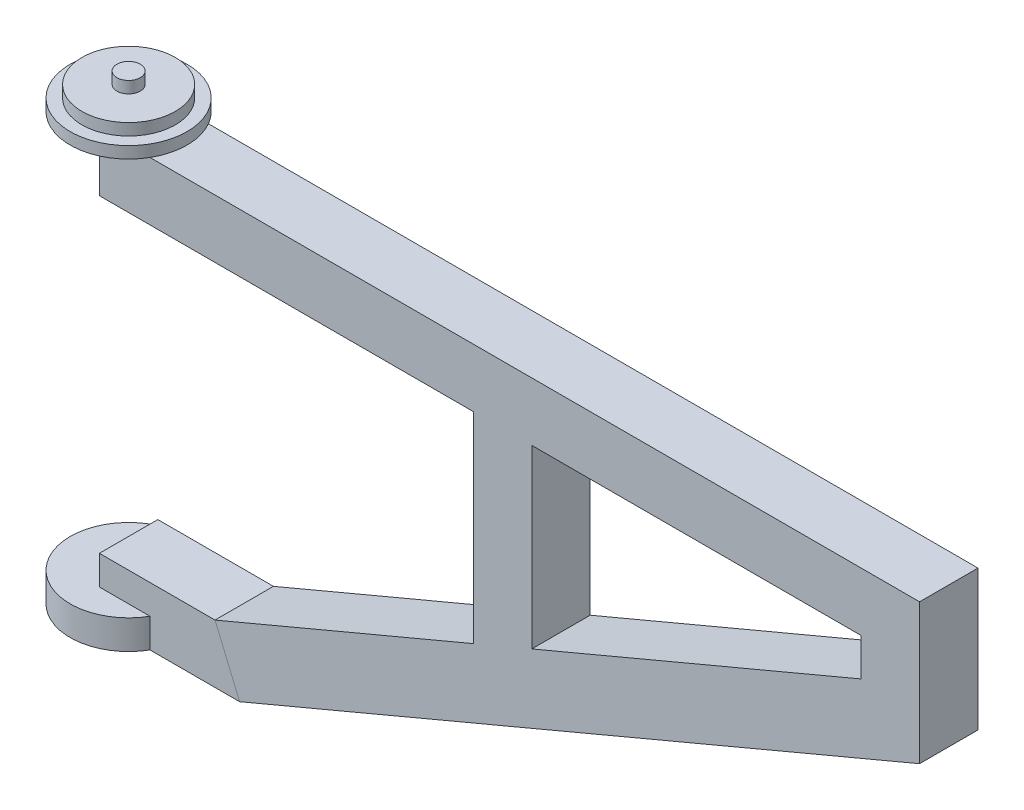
from build123d import *

# Parameters (mm, degrees)
SKETCH1_R            = 12.7
BOSS_EXTRUDE1_DEPTH  = 12.7
SKETCH2_R            = 50.8
BOSS_EXTRUDE2_DEPTH  = 12.7
SKETCH3_R            = 63.5
BOSS_EXTRUDE3_DEPTH  = 12.7
SKETCH5_R            = 63.5
BOSS_EXTRUDE5_DEPTH  = 31.75
SKETCH6_W            = 891.391767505
SKETCH6_H            = 63.5
BOSS_EXTRUDE6_DEPTH  = 63.5
SKETCH7_W            = 891.391767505
SKETCH7_H            = 63.5
BOSS_EXTRUDE7_DEPTH  = 63.5
SKETCH8_W            = 63.5
SKETCH8_H            = 463.55
BOSS_EXTRUDE8_DEPTH  = 63.5
SKETCH9_W            = 63.5
SKETCH9_H            = 463.55
BOSS_EXTRUDE9_DEPTH  = 63.5
CUT_EXTRUDE1_DEPTH   = 1028.280179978
BOSS_EXTRUDE10_DEPTH = 63.5


with BuildPart() as part:
    # Sketch1 → Boss-Extrude1 (new body)
    with BuildSketch(Plane(origin=(0, 0, 0), x_dir=(1, 0, 0), z_dir=(0, 1, 0))):
        with Locations(Location((0, 0, 0), (0, 0, 270))):
            Circle(SKETCH1_R)
    extrude(amount=-BOSS_EXTRUDE1_DEPTH)

    # Sketch2 → Boss-Extrude2 (add)
    with BuildSketch(Plane.XZ.offset(12.7)):
        with Locations(Location((0, 0, 0), (0, 0, 270))):
            Circle(SKETCH2_R)
    extrude(amount=BOSS_EXTRUDE2_DEPTH)

    # Sketch3 → Boss-Extrude3 (add)
    with BuildSketch(Plane.XZ.offset(25.4)):
        with Locations(Location((0, 0, 0), (0, 0, 270))):
            Circle(SKETCH3_R)
    extrude(amount=BOSS_EXTRUDE3_DEPTH)

    # Sketch7 → Boss-Extrude7 (add)
    with BuildSketch(Plane.XZ.offset(38.1)):
        with Locations((445.695883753, 0)):
            Rectangle(SKETCH7_W, SKETCH7_H)
    extrude(amount=BOSS_EXTRUDE7_DEPTH)



with BuildPart() as body_2:
    # Sketch5 → Boss-Extrude5 (new body)
    with BuildSketch(Plane(origin=(0, -501.65, 0), x_dir=(-1, 0, 0), z_dir=(0, -1, 0))):
        with Locations(Location((0, 0, 0), (0, 0, 90))):
            Circle(SKETCH5_R)
    extrude(amount=-BOSS_EXTRUDE5_DEPTH)

    # Sketch6 → Boss-Extrude6 (add)
    with BuildSketch(Plane.XZ.offset(501.65)):
        with Locations((445.695883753, 0)):
            Rectangle(SKETCH6_W, SKETCH6_H)
    extrude(amount=-BOSS_EXTRUDE6_DEPTH)


with BuildPart() as part_1:
    add(part.part)

    add(body_2.part)  # Boss-Extrude8 merges body 2
    # Sketch8 → Boss-Extrude8 (add)
    with BuildSketch(Plane(origin=(0, 0, -31.75), x_dir=(-1, 0, 0), z_dir=(0, 0, -1))):
        with Locations((-859.641767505, -269.875)):
            Rectangle(SKETCH8_W, SKETCH8_H)
    extrude(amount=-BOSS_EXTRUDE8_DEPTH)

    # Sketch9 → Boss-Extrude9 (add)
    with BuildSketch(Plane(origin=(0, 0, -31.75), x_dir=(-1, 0, 0), z_dir=(0, 0, -1))):
        with Locations((-438.15, -269.875)):
            Rectangle(SKETCH9_W, SKETCH9_H)
    extrude(amount=-BOSS_EXTRUDE9_DEPTH)

    # Sketch10 → Cut-Extrude1 (cut, through all)
    with BuildSketch(Plane.XY.offset(31.75)):
        Polygon((152.4, -501.65), (891.391767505, -190.5), (891.391767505, -501.65), align=None)
    extrude(amount=-CUT_EXTRUDE1_DEPTH, mode=Mode.SUBTRACT)


with BuildPart() as cut_extrude1_piece_1:
    # of the separate pieces the step leaves, piece 1, a body of its own (cut_extrude1_pieces)
    add(part_1.part.solids().sort_by_distance((406.4, -394.704153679, 31.75))[0])

    # Sketch11 → Boss-Extrude10 (add)
    with BuildSketch(Plane.XY.offset(31.75)):
        Polygon((891.391767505, -190.5), (864.655305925, -127), (125.66353842, -438.15), (152.4, -501.65), align=None)
    extrude(amount=-BOSS_EXTRUDE10_DEPTH)


with BuildPart() as cut_extrude1_piece_2:
    # of the separate pieces the step leaves, piece 2, a body of its own (cut_extrude1_pieces)
    add(part_1.part.solids().sort_by_distance((54.99261314, -501.65, -31.75))[0])


solid = Compound([cut_extrude1_piece_1.part, cut_extrude1_piece_2.part])
